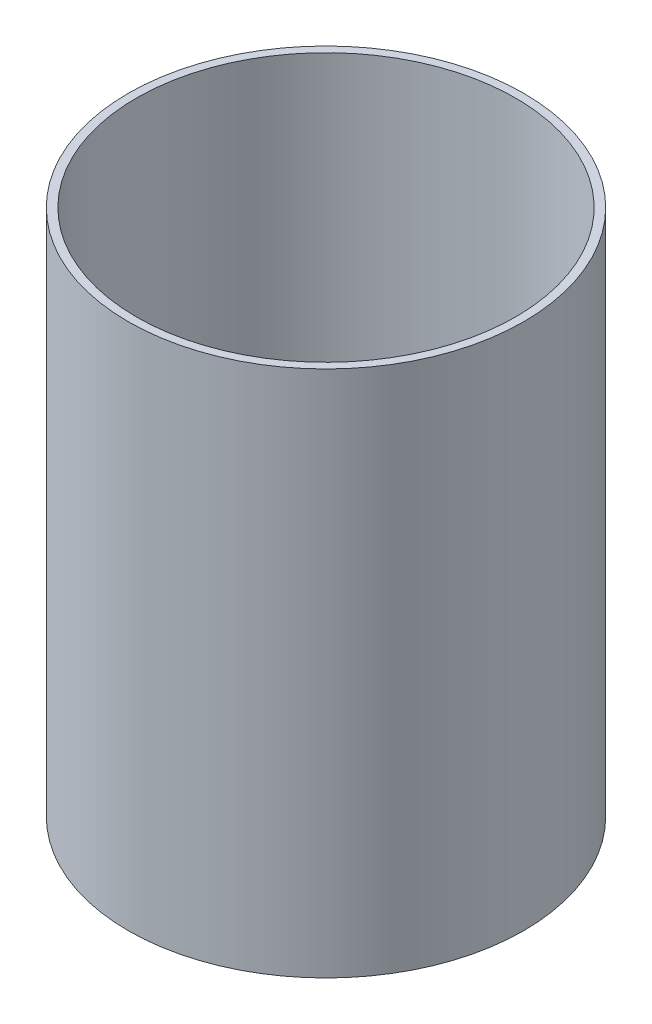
from build123d import *

# Parameters (mm, degrees)
SKETCH1_R           = 19.05
SKETCH1_R_2         = 18.2626
BOSS_EXTRUDE1_DEPTH = 50.8


with BuildPart() as part:
    # Sketch1 → Boss-Extrude1 (new body)
    with BuildSketch(Plane(origin=(0, 0, 0), x_dir=(1, 0, 0), z_dir=(0, 1, 0))):
        with Locations(Location((0, 0, 0), (0, 0, 270))):
            Circle(SKETCH1_R)
        with Locations(Location((0, 0, 0), (0, 0, 270))):
            Circle(SKETCH1_R_2, mode=Mode.SUBTRACT)
    extrude(amount=BOSS_EXTRUDE1_DEPTH)


solid = part.part
